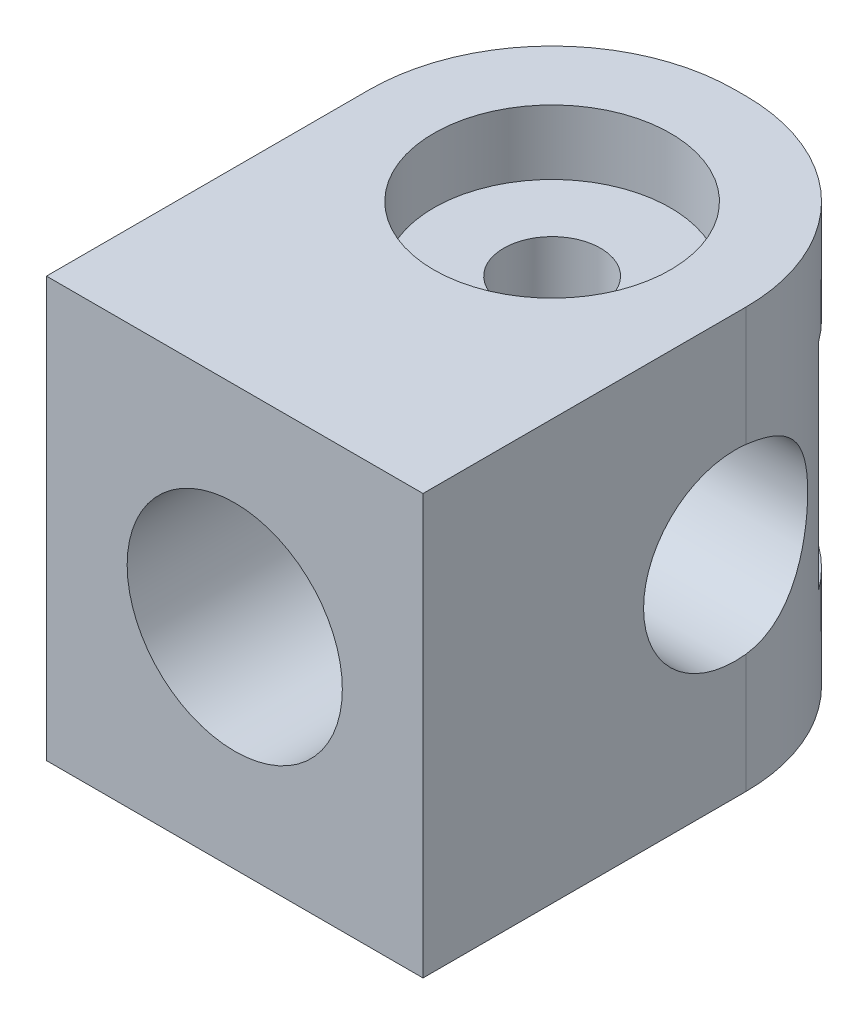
ISO-10303-21;
HEADER;
FILE_DESCRIPTION(('STEP AP214'),'2;1');
FILE_NAME('part.step','',(''),(''),'','','');
FILE_SCHEMA(('AUTOMOTIVE_DESIGN { 1 0 10303 214 1 1 1 1 }'));
ENDSEC;
DATA;
#1=APPLICATION_CONTEXT('core data for automotive mechanical design processes');
#2=APPLICATION_PROTOCOL_DEFINITION('international standard','automotive_design',2000,#1);
#3=PRODUCT_CONTEXT('',#1,'mechanical');
#4=PRODUCT('Part','Part','',(#3));
#5=PRODUCT_RELATED_PRODUCT_CATEGORY('part','',(#4));
#6=PRODUCT_DEFINITION_FORMATION('','',#4);
#7=PRODUCT_DEFINITION_CONTEXT('part definition',#1,'design');
#8=PRODUCT_DEFINITION('design','',#6,#7);
#9=PRODUCT_DEFINITION_SHAPE('','',#8);
#10=(LENGTH_UNIT() NAMED_UNIT(*) SI_UNIT(.MILLI.,.METRE.));
#11=(NAMED_UNIT(*) PLANE_ANGLE_UNIT() SI_UNIT($,.RADIAN.));
#12=(NAMED_UNIT(*) SI_UNIT($,.STERADIAN.) SOLID_ANGLE_UNIT());
#13=UNCERTAINTY_MEASURE_WITH_UNIT(LENGTH_MEASURE(1.E-05),#10,'distance_accuracy_value','');
#14=(GEOMETRIC_REPRESENTATION_CONTEXT(3) GLOBAL_UNCERTAINTY_ASSIGNED_CONTEXT((#13)) GLOBAL_UNIT_ASSIGNED_CONTEXT((#10,
#11,#12)) REPRESENTATION_CONTEXT('',''));
#15=CARTESIAN_POINT('',(0.,0.,0.));
#16=DIRECTION('',(0.,0.,1.));
#17=DIRECTION('',(1.,0.,0.));
#18=AXIS2_PLACEMENT_3D('',#15,#16,#17);
#19=CARTESIAN_POINT('',(17.5,-39.,17.5));
#20=DIRECTION('',(0.,1.,0.));
#21=DIRECTION('',(0.,0.,1.));
#22=AXIS2_PLACEMENT_3D('',#19,#20,#21);
#23=CYLINDRICAL_SURFACE('',#22,4.5);
#24=CARTESIAN_POINT('',(17.5,-27.,22.));
#25=CARTESIAN_POINT('',(17.3812277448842,-26.9999960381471,22.0000031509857));
#26=CARTESIAN_POINT('',(17.262486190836,-27.0025147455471,21.995294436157));
#27=CARTESIAN_POINT('',(17.0259169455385,-27.0124783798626,21.9765297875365));
#28=CARTESIAN_POINT('',(16.908089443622,-27.019924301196,21.962471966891));
#29=CARTESIAN_POINT('',(16.6741993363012,-27.0394641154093,21.9251652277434));
#30=CARTESIAN_POINT('',(16.5581381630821,-27.0515615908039,21.9019092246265));
#31=CARTESIAN_POINT('',(16.3286691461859,-27.0799410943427,21.8464858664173));
#32=CARTESIAN_POINT('',(16.215262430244,-27.0962248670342,21.8143147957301));
#33=CARTESIAN_POINT('',(15.8812611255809,-27.1503350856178,21.7052656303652));
#34=CARTESIAN_POINT('',(15.6655564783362,-27.1935421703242,21.6156351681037));
#35=CARTESIAN_POINT('',(15.2522300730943,-27.2889109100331,21.4053082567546));
#36=CARTESIAN_POINT('',(15.0546129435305,-27.3410748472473,21.2846038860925));
#37=CARTESIAN_POINT('',(14.6667979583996,-27.452668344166,21.0048946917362));
#38=CARTESIAN_POINT('',(14.4782430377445,-27.5123497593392,20.8437100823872));
#39=CARTESIAN_POINT('',(14.129518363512,-27.6286486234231,20.4918471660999));
#40=CARTESIAN_POINT('',(13.9693585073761,-27.6852649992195,20.3011586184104));
#41=CARTESIAN_POINT('',(13.750432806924,-27.7641328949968,19.9915340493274));
#42=CARTESIAN_POINT('',(13.6797373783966,-27.7898967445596,19.8817471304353));
#43=CARTESIAN_POINT('',(13.5478818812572,-27.8379463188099,19.6558841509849));
#44=CARTESIAN_POINT('',(13.4867177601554,-27.8602335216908,19.539810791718));
#45=CARTESIAN_POINT('',(13.3745490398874,-27.9005240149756,19.3021967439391));
#46=CARTESIAN_POINT('',(13.323540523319,-27.9185289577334,19.1806581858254));
#47=CARTESIAN_POINT('',(13.232226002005,-27.9495596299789,18.9330086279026));
#48=CARTESIAN_POINT('',(13.1919187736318,-27.9625859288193,18.8068981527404));
#49=CARTESIAN_POINT('',(13.1253749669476,-27.9822297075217,18.5618002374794));
#50=CARTESIAN_POINT('',(13.0982488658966,-27.989288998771,18.4430891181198));
#51=CARTESIAN_POINT('',(13.0536909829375,-27.9984034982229,18.2036748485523));
#52=CARTESIAN_POINT('',(13.0362583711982,-28.0004591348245,18.0829718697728));
#53=CARTESIAN_POINT('',(13.0112569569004,-27.9993691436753,17.8406179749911));
#54=CARTESIAN_POINT('',(13.0036843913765,-27.9962255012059,17.718967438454));
#55=CARTESIAN_POINT('',(12.9984212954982,-27.9846887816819,17.475706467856));
#56=CARTESIAN_POINT('',(13.0007303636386,-27.9762959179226,17.3540960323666));
#57=CARTESIAN_POINT('',(13.0145775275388,-27.9551876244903,17.1211250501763));
#58=CARTESIAN_POINT('',(13.025401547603,-27.9428487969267,17.0096873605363));
#59=CARTESIAN_POINT('',(13.0552077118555,-27.9139542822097,16.7884520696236));
#60=CARTESIAN_POINT('',(13.0741924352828,-27.897397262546,16.6786549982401));
#61=CARTESIAN_POINT('',(13.1430256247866,-27.8417792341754,16.3528578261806));
#62=CARTESIAN_POINT('',(13.2047653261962,-27.7967529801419,16.1402562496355));
#63=CARTESIAN_POINT('',(13.3600872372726,-27.6918882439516,15.7215336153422));
#64=CARTESIAN_POINT('',(13.4547768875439,-27.6315575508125,15.5159546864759));
#65=CARTESIAN_POINT('',(13.6721086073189,-27.5011702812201,15.1235329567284));
#66=CARTESIAN_POINT('',(13.7947613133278,-27.4311100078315,14.9366973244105));
#67=CARTESIAN_POINT('',(14.0811600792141,-27.2772520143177,14.5634666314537));
#68=CARTESIAN_POINT('',(14.248053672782,-27.1928102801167,14.3797484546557));
#69=CARTESIAN_POINT('',(14.6099783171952,-27.0245100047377,14.0417844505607));
#70=CARTESIAN_POINT('',(14.8050449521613,-26.9406523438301,13.8875764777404));
#71=CARTESIAN_POINT('',(15.2365863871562,-26.7754361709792,13.6014374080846));
#72=CARTESIAN_POINT('',(15.4750831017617,-26.6947540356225,13.4720962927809));
#73=CARTESIAN_POINT('',(15.8508545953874,-26.5898581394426,13.3108586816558));
#74=CARTESIAN_POINT('',(15.9790534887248,-26.5575917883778,13.2625897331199));
#75=CARTESIAN_POINT('',(16.2406700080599,-26.499803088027,13.1776168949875));
#76=CARTESIAN_POINT('',(16.3740853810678,-26.4742778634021,13.1409080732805));
#77=CARTESIAN_POINT('',(16.710370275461,-26.4209449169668,13.0650541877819));
#78=CARTESIAN_POINT('',(16.9157550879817,-26.3979543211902,13.033244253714));
#79=CARTESIAN_POINT('',(17.3300649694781,-26.372742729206,12.9984107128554));
#80=CARTESIAN_POINT('',(17.5389871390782,-26.3705054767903,12.9953645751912));
#81=CARTESIAN_POINT('',(17.9542812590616,-26.3870513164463,13.0181630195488));
#82=CARTESIAN_POINT('',(18.160654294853,-26.4058251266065,13.043994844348));
#83=CARTESIAN_POINT('',(18.565487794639,-26.4618975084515,13.1230875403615));
#84=CARTESIAN_POINT('',(18.7639422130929,-26.4992099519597,13.1763689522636));
#85=CARTESIAN_POINT('',(19.1557022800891,-26.5897125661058,13.3103631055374));
#86=CARTESIAN_POINT('',(19.3485717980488,-26.6434216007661,13.3919864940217));
#87=CARTESIAN_POINT('',(19.7187414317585,-26.760953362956,13.579504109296));
#88=CARTESIAN_POINT('',(19.8960347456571,-26.8247804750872,13.6854088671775));
#89=CARTESIAN_POINT('',(20.2636083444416,-26.9695643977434,13.9403485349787));
#90=CARTESIAN_POINT('',(20.4504860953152,-27.0515370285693,14.0937151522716));
#91=CARTESIAN_POINT('',(20.7975854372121,-27.2155138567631,14.4285072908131));
#92=CARTESIAN_POINT('',(20.9577844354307,-27.297518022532,14.6099563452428));
#93=CARTESIAN_POINT('',(21.1830290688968,-27.4196691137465,14.9109456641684));
#94=CARTESIAN_POINT('',(21.2585700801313,-27.4621221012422,15.0218435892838));
#95=CARTESIAN_POINT('',(21.3998600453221,-27.5440243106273,15.2507418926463));
#96=CARTESIAN_POINT('',(21.4656127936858,-27.5834746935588,15.3687394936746));
#97=CARTESIAN_POINT('',(21.5866376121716,-27.6584008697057,15.6111531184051));
#98=CARTESIAN_POINT('',(21.641912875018,-27.6938778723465,15.7355671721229));
#99=CARTESIAN_POINT('',(21.7412982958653,-27.7599790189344,15.9900213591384));
#100=CARTESIAN_POINT('',(21.7854099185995,-27.7906037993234,16.1200607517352));
#101=CARTESIAN_POINT('',(21.8588511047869,-27.8440741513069,16.3745723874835));
#102=CARTESIAN_POINT('',(21.8890561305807,-27.8673366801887,16.4987044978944));
#103=CARTESIAN_POINT('',(21.938895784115,-27.9085392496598,16.7499346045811));
#104=CARTESIAN_POINT('',(21.9585318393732,-27.9264800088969,16.8770321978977));
#105=CARTESIAN_POINT('',(21.9868589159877,-27.9566515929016,17.1330262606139));
#106=CARTESIAN_POINT('',(21.9955574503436,-27.9688863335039,17.2619214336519));
#107=CARTESIAN_POINT('',(22.0018097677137,-27.9874476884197,17.5204018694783));
#108=CARTESIAN_POINT('',(21.999364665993,-27.9937748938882,17.6499870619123));
#109=CARTESIAN_POINT('',(21.9842139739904,-28.0001049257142,17.8936468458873));
#110=CARTESIAN_POINT('',(21.9727272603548,-28.000754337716,18.007782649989));
#111=CARTESIAN_POINT('',(21.9410793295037,-27.9975145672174,18.2348162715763));
#112=CARTESIAN_POINT('',(21.920915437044,-27.9936239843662,18.3477136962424));
#113=CARTESIAN_POINT('',(21.8720985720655,-27.9815129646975,18.5713758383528));
#114=CARTESIAN_POINT('',(21.8434489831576,-27.9732942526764,18.6821413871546));
#115=CARTESIAN_POINT('',(21.7779292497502,-27.9528436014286,18.9008486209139));
#116=CARTESIAN_POINT('',(21.7410559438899,-27.9406101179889,19.0087892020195));
#117=CARTESIAN_POINT('',(21.619178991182,-27.8986612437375,19.3257132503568));
#118=CARTESIAN_POINT('',(21.5225097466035,-27.8635866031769,19.5296459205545));
#119=CARTESIAN_POINT('',(21.3010568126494,-27.7829082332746,19.9191523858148));
#120=CARTESIAN_POINT('',(21.1762650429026,-27.7373014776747,20.10472088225));
#121=CARTESIAN_POINT('',(20.8892971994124,-27.6355910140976,20.4700629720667));
#122=CARTESIAN_POINT('',(20.724778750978,-27.5789137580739,20.647841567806));
#123=CARTESIAN_POINT('',(20.3695925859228,-27.4643568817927,20.9747438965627));
#124=CARTESIAN_POINT('',(20.1789014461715,-27.4064762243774,21.1238416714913));
#125=CARTESIAN_POINT('',(19.7597552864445,-27.291869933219,21.4001179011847));
#126=CARTESIAN_POINT('',(19.5295485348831,-27.2355481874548,21.5248512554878));
#127=CARTESIAN_POINT('',(19.1691500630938,-27.1618031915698,21.681042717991));
#128=CARTESIAN_POINT('',(19.0465401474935,-27.1390161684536,21.7279460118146));
#129=CARTESIAN_POINT('',(18.7970292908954,-27.0979073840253,21.8110300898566));
#130=CARTESIAN_POINT('',(18.6701299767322,-27.0795839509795,21.8472148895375));
#131=CARTESIAN_POINT('',(18.3719124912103,-27.0432152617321,21.9181621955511));
#132=CARTESIAN_POINT('',(18.1993472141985,-27.0271263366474,21.9487826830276));
#133=CARTESIAN_POINT('',(17.8511651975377,-27.0055226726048,21.9896972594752));
#134=CARTESIAN_POINT('',(17.6755490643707,-27.0000058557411,21.9999953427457));
#135=CARTESIAN_POINT('',(17.5,-27.,22.));
#136=B_SPLINE_CURVE_WITH_KNOTS('',3,(#24,#25,#26,#27,#28,#29,#30,#31,#32,#33,#34,#35,#36,#37,
#38,#39,#40,#41,#42,#43,#44,#45,#46,#47,#48,#49,#50,#51,#52,#53,#54,#55,#56,#57,#58,#59,#60,#61,
#62,#63,#64,#65,#66,#67,#68,#69,#70,#71,#72,#73,#74,#75,#76,#77,#78,#79,#80,#81,#82,#83,#84,#85,
#86,#87,#88,#89,#90,#91,#92,#93,#94,#95,#96,#97,#98,#99,#100,#101,#102,#103,#104,#105,#106,#107,
#108,#109,#110,#111,#112,#113,#114,#115,#116,#117,#118,#119,#120,#121,#122,#123,#124,#125,#126,
#127,#128,#129,#130,#131,#132,#133,#134,#135),.UNSPECIFIED.,.T.,.F.,(4,2,2,2,2,2,2,2,2,2,2,2,2,
2,2,2,2,2,2,2,2,2,2,2,2,2,2,2,2,2,2,2,2,2,2,2,2,2,2,2,2,2,2,2,2,2,2,2,2,2,2,2,2,2,2,4),(0.,
0.356144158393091,0.712360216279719,1.06885117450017,1.42549093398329,2.13476597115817,
2.84422200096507,3.60640487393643,4.3688528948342,4.7676970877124,5.16637123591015,
5.56489130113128,5.96336577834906,6.32880274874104,6.6942084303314,7.0594746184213,
7.42472596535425,7.76224366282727,8.09986811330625,8.77453388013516,9.47450377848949,
10.1747403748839,10.9579719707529,11.7422016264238,12.5861396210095,13.007723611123,
13.4291274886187,14.0534056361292,14.6771947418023,15.3007083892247,15.9246892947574,
16.5709266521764,17.2174448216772,17.9802839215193,18.7437657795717,19.1655119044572,
19.5870941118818,20.0085476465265,20.4299458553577,20.8189606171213,21.2079228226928,
21.59661770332,21.9852736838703,22.3289978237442,22.6728280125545,23.0165212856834,
23.3603469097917,24.0423823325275,24.7246139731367,25.4677285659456,26.2115125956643,
27.010448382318,27.4096854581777,27.8087727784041,28.3352683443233,28.8616604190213),.UNSPECIFIED.);
#137=CARTESIAN_POINT('',(17.5,-27.,22.));
#138=VERTEX_POINT('',#137);
#139=EDGE_CURVE('E202',#138,#138,#136,.T.);
#140=ORIENTED_EDGE('',*,*,#139,.F.);
#141=EDGE_LOOP('',(#140));
#142=FACE_BOUND('',#141,.T.);
#143=CARTESIAN_POINT('',(17.5,-33.,17.5));
#144=DIRECTION('',(0.,-1.,0.));
#145=DIRECTION('',(0.,0.,-1.));
#146=AXIS2_PLACEMENT_3D('',#143,#144,#145);
#147=CIRCLE('',#146,4.5);
#148=CARTESIAN_POINT('',(17.5,-33.,13.));
#149=VERTEX_POINT('',#148);
#150=EDGE_CURVE('E255',#149,#149,#147,.F.);
#151=ORIENTED_EDGE('',*,*,#150,.F.);
#152=EDGE_LOOP('',(#151));
#153=FACE_BOUND('',#152,.T.);
#154=ADVANCED_FACE('F47',(#142,#153),#23,.F.);
#155=CARTESIAN_POINT('',(13.0278640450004,-11.,18.));
#156=CARTESIAN_POINT('',(13.0410960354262,-10.9999970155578,18.1183807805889));
#157=CARTESIAN_POINT('',(13.0590342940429,-11.0024770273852,18.2362010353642));
#158=CARTESIAN_POINT('',(13.1041541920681,-11.0121931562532,18.4698945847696));
#159=CARTESIAN_POINT('',(13.1313376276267,-11.0194301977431,18.5857674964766));
#160=CARTESIAN_POINT('',(13.1947016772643,-11.0383563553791,18.8147336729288));
#161=CARTESIAN_POINT('',(13.2308882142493,-11.050048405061,18.9278250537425));
#162=CARTESIAN_POINT('',(13.3118898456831,-11.0774583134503,19.1503882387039));
#163=CARTESIAN_POINT('',(13.356708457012,-11.0931778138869,19.2598585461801));
#164=CARTESIAN_POINT('',(13.50308584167,-11.1454932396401,19.5807916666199));
#165=CARTESIAN_POINT('',(13.6168990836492,-11.1873528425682,19.785965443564));
#166=CARTESIAN_POINT('',(13.8736042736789,-11.2804446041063,20.1746252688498));
#167=CARTESIAN_POINT('',(14.0165012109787,-11.3316783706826,20.3581075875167));
#168=CARTESIAN_POINT('',(14.3384631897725,-11.4419169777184,20.7117970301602));
#169=CARTESIAN_POINT('',(14.5193094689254,-11.5012124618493,20.8802923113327));
#170=CARTESIAN_POINT('',(14.9067047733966,-11.617929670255,21.1858723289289));
#171=CARTESIAN_POINT('',(15.1132678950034,-11.6753503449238,21.3229397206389));
#172=CARTESIAN_POINT('',(15.4446044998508,-11.7561219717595,21.5052938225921));
#173=CARTESIAN_POINT('',(15.5617517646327,-11.7827236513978,21.5632939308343));
#174=CARTESIAN_POINT('',(15.8012535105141,-11.8324619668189,21.6690975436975));
#175=CARTESIAN_POINT('',(15.9236056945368,-11.855600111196,21.7169054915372));
#176=CARTESIAN_POINT('',(16.1726201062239,-11.8974563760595,21.8017854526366));
#177=CARTESIAN_POINT('',(16.2992793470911,-11.9161774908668,21.8388647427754));
#178=CARTESIAN_POINT('',(16.5559965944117,-11.9483912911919,21.9018536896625));
#179=CARTESIAN_POINT('',(16.6860541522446,-11.9618846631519,21.9277648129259));
#180=CARTESIAN_POINT('',(16.9371182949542,-11.9820976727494,21.9663048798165));
#181=CARTESIAN_POINT('',(17.0579406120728,-11.9893003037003,21.9798849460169));
#182=CARTESIAN_POINT('',(17.3004821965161,-11.9985104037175,21.9972180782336));
#183=CARTESIAN_POINT('',(17.4222013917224,-12.0005182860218,22.0009719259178));
#184=CARTESIAN_POINT('',(17.6654857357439,-11.999253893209,21.9986008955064));
#185=CARTESIAN_POINT('',(17.7870509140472,-11.9959828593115,21.9924783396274));
#186=CARTESIAN_POINT('',(18.0290357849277,-11.9843019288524,21.970445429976));
#187=CARTESIAN_POINT('',(18.1494555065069,-11.9758921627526,21.9545353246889));
#188=CARTESIAN_POINT('',(18.3789688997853,-11.9551150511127,21.9147378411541));
#189=CARTESIAN_POINT('',(18.4882189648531,-11.9431035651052,21.8915615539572));
#190=CARTESIAN_POINT('',(18.7042740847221,-11.9154056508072,21.8372971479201));
#191=CARTESIAN_POINT('',(18.8110783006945,-11.8997179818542,21.8062063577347));
#192=CARTESIAN_POINT('',(19.1268646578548,-11.8478649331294,21.7014789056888));
#193=CARTESIAN_POINT('',(19.3313673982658,-11.8068951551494,21.6163612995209));
#194=CARTESIAN_POINT('',(19.7381982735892,-11.7135723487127,21.4110225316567));
#195=CARTESIAN_POINT('',(19.9393320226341,-11.6606160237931,21.2887314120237));
#196=CARTESIAN_POINT('',(20.319635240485,-11.5512862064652,21.0149158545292));
#197=CARTESIAN_POINT('',(20.4987918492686,-11.4949107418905,20.8633744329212));
#198=CARTESIAN_POINT('',(20.8483888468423,-11.3790875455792,20.5173630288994));
#199=CARTESIAN_POINT('',(21.0162145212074,-11.3198874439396,20.3201295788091));
#200=CARTESIAN_POINT('',(21.2414204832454,-11.2388223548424,20.0037178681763));
#201=CARTESIAN_POINT('',(21.3120981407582,-11.213077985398,19.8947557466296));
#202=CARTESIAN_POINT('',(21.4440403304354,-11.1649979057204,19.6705827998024));
#203=CARTESIAN_POINT('',(21.5053096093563,-11.1426604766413,19.5553751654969));
#204=CARTESIAN_POINT('',(21.616422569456,-11.1026933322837,19.3224434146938));
#205=CARTESIAN_POINT('',(21.6665153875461,-11.0849591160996,19.2048559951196));
#206=CARTESIAN_POINT('',(21.7566528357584,-11.0541338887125,18.9653548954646));
#207=CARTESIAN_POINT('',(21.7967023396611,-11.0410406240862,18.8434433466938));
#208=CARTESIAN_POINT('',(21.8663069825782,-11.0200342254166,18.59628399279));
#209=CARTESIAN_POINT('',(21.8958672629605,-11.0121185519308,18.471037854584));
#210=CARTESIAN_POINT('',(21.9441716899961,-11.0018614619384,18.2182552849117));
#211=CARTESIAN_POINT('',(21.9629169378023,-10.9995194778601,18.0907190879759));
#212=CARTESIAN_POINT('',(21.988067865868,-11.0005884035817,17.8473835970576));
#213=CARTESIAN_POINT('',(21.9955218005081,-11.0034463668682,17.7316887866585));
#214=CARTESIAN_POINT('',(22.001489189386,-11.0139132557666,17.5002449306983));
#215=CARTESIAN_POINT('',(21.9999997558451,-11.0215237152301,17.3844958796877));
#216=CARTESIAN_POINT('',(21.9881551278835,-11.0414241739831,17.1539071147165));
#217=CARTESIAN_POINT('',(21.9778039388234,-11.0537120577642,17.0390670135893));
#218=CARTESIAN_POINT('',(21.9484379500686,-11.082775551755,16.8110609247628));
#219=CARTESIAN_POINT('',(21.9294198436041,-11.0995528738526,16.6978955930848));
#220=CARTESIAN_POINT('',(21.8609228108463,-11.1552603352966,16.3678018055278));
#221=CARTESIAN_POINT('',(21.7996575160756,-11.200115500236,16.1541850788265));
#222=CARTESIAN_POINT('',(21.6478897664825,-11.3028627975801,15.7411498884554));
#223=CARTESIAN_POINT('',(21.5573812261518,-11.3607576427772,15.5417343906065));
#224=CARTESIAN_POINT('',(21.3409934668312,-11.491332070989,15.1436355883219));
#225=CARTESIAN_POINT('',(21.2127166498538,-11.5648610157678,14.9465351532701));
#226=CARTESIAN_POINT('',(20.9283978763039,-11.7176249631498,14.5758300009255));
#227=CARTESIAN_POINT('',(20.7723285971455,-11.7968655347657,14.4022487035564));
#228=CARTESIAN_POINT('',(20.4151245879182,-11.9646067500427,14.0619887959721));
#229=CARTESIAN_POINT('',(20.2108368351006,-12.0530868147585,13.8985917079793));
#230=CARTESIAN_POINT('',(19.7743751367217,-12.2205426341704,13.6082339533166));
#231=CARTESIAN_POINT('',(19.5422212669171,-12.2995251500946,13.4812472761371));
#232=CARTESIAN_POINT('',(19.1009958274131,-12.4242253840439,13.2889502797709));
#233=CARTESIAN_POINT('',(18.8960738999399,-12.4734193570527,13.2164747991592));
#234=CARTESIAN_POINT('',(18.5801324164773,-12.5332128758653,13.1301872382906));
#235=CARTESIAN_POINT('',(18.4734007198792,-12.5508103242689,13.105163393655));
#236=CARTESIAN_POINT('',(18.2577047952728,-12.5807783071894,13.0628904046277));
#237=CARTESIAN_POINT('',(18.1487415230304,-12.5931510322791,13.0456380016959));
#238=CARTESIAN_POINT('',(17.9287674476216,-12.6122669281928,13.0190962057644));
#239=CARTESIAN_POINT('',(17.8177488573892,-12.6189799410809,13.0098494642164));
#240=CARTESIAN_POINT('',(17.5951291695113,-12.6264055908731,12.9996259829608));
#241=CARTESIAN_POINT('',(17.483528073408,-12.6271182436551,12.9986492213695));
#242=CARTESIAN_POINT('',(17.2606627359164,-12.6225104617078,13.0049869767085));
#243=CARTESIAN_POINT('',(17.1493985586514,-12.6171889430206,13.0123029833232));
#244=CARTESIAN_POINT('',(16.9281754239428,-12.6007335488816,13.0350923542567));
#245=CARTESIAN_POINT('',(16.8182164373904,-12.5895998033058,13.050565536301));
#246=CARTESIAN_POINT('',(16.5078250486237,-12.5501344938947,13.1059843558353));
#247=CARTESIAN_POINT('',(16.3098500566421,-12.5152273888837,13.155553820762));
#248=CARTESIAN_POINT('',(15.9253564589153,-12.4307885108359,13.279639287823));
#249=CARTESIAN_POINT('',(15.7388421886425,-12.381251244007,13.354164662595));
#250=CARTESIAN_POINT('',(15.3587350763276,-12.265750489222,13.5358640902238));
#251=CARTESIAN_POINT('',(15.1668608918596,-12.1985440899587,13.6458352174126));
#252=CARTESIAN_POINT('',(14.8027475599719,-12.0576775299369,13.8912457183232));
#253=CARTESIAN_POINT('',(14.6305225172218,-11.9840127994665,14.0267032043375));
#254=CARTESIAN_POINT('',(14.2795071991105,-11.8227775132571,14.3465543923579));
#255=CARTESIAN_POINT('',(14.1048042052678,-11.7350209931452,14.5353623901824));
#256=CARTESIAN_POINT('',(13.7887452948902,-11.5660435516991,14.9421054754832));
#257=CARTESIAN_POINT('',(13.647406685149,-11.4848260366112,15.160055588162));
#258=CARTESIAN_POINT('',(13.4627467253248,-11.3725819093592,15.5079186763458));
#259=CARTESIAN_POINT('',(13.4052670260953,-11.3364146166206,15.6288430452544));
#260=CARTESIAN_POINT('',(13.3009664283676,-11.2685550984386,15.876384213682));
#261=CARTESIAN_POINT('',(13.2541401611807,-11.2368606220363,16.0029981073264));
#262=CARTESIAN_POINT('',(13.1718642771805,-11.1787771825,16.260836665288));
#263=CARTESIAN_POINT('',(13.1363974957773,-11.1523802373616,16.3920540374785));
#264=CARTESIAN_POINT('',(13.0773547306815,-11.1055027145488,16.6581126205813));
#265=CARTESIAN_POINT('',(13.0537739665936,-11.0850197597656,16.7929523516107));
#266=CARTESIAN_POINT('',(13.0137929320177,-11.0453221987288,17.1055539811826));
#267=CARTESIAN_POINT('',(13.001612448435,-11.0282956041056,17.2841571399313));
#268=CARTESIAN_POINT('',(12.9986883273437,-11.0056374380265,17.6422638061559));
#269=CARTESIAN_POINT('',(13.0079421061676,-11.0000044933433,17.8217672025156));
#270=CARTESIAN_POINT('',(13.0278640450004,-11.,18.));
#271=B_SPLINE_CURVE_WITH_KNOTS('',3,(#155,#156,#157,#158,#159,#160,#161,#162,#163,#164,#165,
#166,#167,#168,#169,#170,#171,#172,#173,#174,#175,#176,#177,#178,#179,#180,#181,#182,#183,#184,
#185,#186,#187,#188,#189,#190,#191,#192,#193,#194,#195,#196,#197,#198,#199,#200,#201,#202,#203,
#204,#205,#206,#207,#208,#209,#210,#211,#212,#213,#214,#215,#216,#217,#218,#219,#220,#221,#222,
#223,#224,#225,#226,#227,#228,#229,#230,#231,#232,#233,#234,#235,#236,#237,#238,#239,#240,#241,
#242,#243,#244,#245,#246,#247,#248,#249,#250,#251,#252,#253,#254,#255,#256,#257,#258,#259,#260,
#261,#262,#263,#264,#265,#266,#267,#268,#269,#270),.UNSPECIFIED.,.T.,.F.,(4,2,2,2,2,2,2,2,2,2,2,
2,2,2,2,2,2,2,2,2,2,2,2,2,2,2,2,2,2,2,2,2,2,2,2,2,2,2,2,2,2,2,2,2,2,2,2,2,2,2,2,2,2,2,2,2,2,4),
(0.,0.357176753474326,0.714422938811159,1.07190477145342,1.42953255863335,2.1411176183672,
2.85282485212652,3.61219301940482,4.37197927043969,4.77172859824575,5.17130329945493,
5.57060634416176,5.96985693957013,6.33474964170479,6.69961331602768,7.06439121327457,
7.42915984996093,7.76575352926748,8.10246096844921,8.77543142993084,9.49637841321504,
10.2177452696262,11.0104604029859,11.4072482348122,11.8038352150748,12.1904224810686,
12.576821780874,12.9630314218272,13.3492017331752,13.696676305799,14.0442630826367,
14.3916928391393,14.7392552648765,15.4162348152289,16.0933553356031,16.8295722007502,
17.566516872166,18.391188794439,19.2152701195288,19.8808372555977,20.2135694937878,
20.5461620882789,20.8805159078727,21.2148688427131,21.5492818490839,21.8836873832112,
22.5020407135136,23.1206265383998,23.8114794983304,24.502825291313,25.3146638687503,
26.1269226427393,26.5424917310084,26.9578509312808,27.3725795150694,27.7871411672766,
28.3249673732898,28.8627287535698),.UNSPECIFIED.);
#272=CARTESIAN_POINT('',(13.0278640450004,-11.,18.));
#273=VERTEX_POINT('',#272);
#274=EDGE_CURVE('E211',#273,#273,#271,.T.);
#275=ORIENTED_EDGE('',*,*,#274,.F.);
#276=EDGE_LOOP('',(#275));
#277=FACE_BOUND('',#276,.T.);
#278=CARTESIAN_POINT('',(17.5,-6.,17.5));
#279=DIRECTION('',(0.,1.,0.));
#280=DIRECTION('',(0.,0.,1.));
#281=AXIS2_PLACEMENT_3D('',#278,#279,#280);
#282=CIRCLE('',#281,4.5);
#283=CARTESIAN_POINT('',(17.5,-6.,22.));
#284=VERTEX_POINT('',#283);
#285=EDGE_CURVE('E212',#284,#284,#282,.F.);
#286=ORIENTED_EDGE('',*,*,#285,.F.);
#287=EDGE_LOOP('',(#286));
#288=FACE_BOUND('',#287,.T.);
#289=ADVANCED_FACE('F221',(#277,#288),#23,.F.);
#290=CARTESIAN_POINT('',(0.,0.,0.));
#291=DIRECTION('',(0.,0.,1.));
#292=DIRECTION('',(1.,0.,0.));
#293=AXIS2_PLACEMENT_3D('',#290,#291,#292);
#294=PLANE('',#293);
#295=DIRECTION('',(-1.,0.,0.));
#296=VECTOR('',#295,1.);
#297=CARTESIAN_POINT('',(0.,-9.5,0.));
#298=LINE('',#297,#296);
#299=CARTESIAN_POINT('',(18.,-9.5,0.));
#300=VERTEX_POINT('',#299);
#301=CARTESIAN_POINT('',(17.,-9.5,0.));
#302=VERTEX_POINT('',#301);
#303=EDGE_CURVE('E287',#300,#302,#298,.T.);
#304=ORIENTED_EDGE('',*,*,#303,.T.);
#305=DIRECTION('',(0.,-1.,0.));
#306=VECTOR('',#305,1.);
#307=CARTESIAN_POINT('',(17.,0.,0.));
#308=LINE('',#307,#306);
#309=CARTESIAN_POINT('',(17.,0.,0.));
#310=VERTEX_POINT('',#309);
#311=EDGE_CURVE('E173',#302,#310,#308,.F.);
#312=ORIENTED_EDGE('',*,*,#311,.T.);
#313=DIRECTION('',(-1.,0.,0.));
#314=VECTOR('',#313,1.);
#315=CARTESIAN_POINT('',(0.,0.,0.));
#316=LINE('',#315,#314);
#317=CARTESIAN_POINT('',(18.,0.,0.));
#318=VERTEX_POINT('',#317);
#319=EDGE_CURVE('E327',#318,#310,#316,.T.);
#320=ORIENTED_EDGE('',*,*,#319,.F.);
#321=DIRECTION('',(0.,1.,0.));
#322=VECTOR('',#321,1.);
#323=CARTESIAN_POINT('',(18.,0.,0.));
#324=LINE('',#323,#322);
#325=EDGE_CURVE('E169',#318,#300,#324,.F.);
#326=ORIENTED_EDGE('',*,*,#325,.T.);
#327=EDGE_LOOP('',(#304,#312,#320,#326));
#328=FACE_BOUND('',#327,.T.);
#329=ADVANCED_FACE('F225',(#328),#294,.F.);
#330=CARTESIAN_POINT('',(17.,0.,17.));
#331=DIRECTION('',(0.,-1.,0.));
#332=DIRECTION('',(1.,0.,0.));
#333=AXIS2_PLACEMENT_3D('',#330,#331,#332);
#334=CYLINDRICAL_SURFACE('',#333,17.);
#335=CARTESIAN_POINT('',(0.,-15.1125178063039,17.));
#336=CARTESIAN_POINT('',(-1.15018497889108E-05,-15.1403187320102,16.8779552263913));
#337=CARTESIAN_POINT('',(0.00131393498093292,-15.1732390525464,16.7570854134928));
#338=CARTESIAN_POINT('',(0.006402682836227,-15.2490011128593,16.5185731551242));
#339=CARTESIAN_POINT('',(0.0101655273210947,-15.2918409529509,16.4009300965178));
#340=CARTESIAN_POINT('',(0.0198850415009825,-15.3870550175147,16.1698968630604));
#341=CARTESIAN_POINT('',(0.0258379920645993,-15.4394130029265,16.056499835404));
#342=CARTESIAN_POINT('',(0.0396327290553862,-15.5533135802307,15.8345377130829));
#343=CARTESIAN_POINT('',(0.0474745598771,-15.614856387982,15.7259727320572));
#344=CARTESIAN_POINT('',(0.0646997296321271,-15.7466607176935,15.5144496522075));
#345=CARTESIAN_POINT('',(0.0740824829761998,-15.8169189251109,15.4114894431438));
#346=CARTESIAN_POINT('',(0.0940117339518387,-15.9656701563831,15.2118034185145));
#347=CARTESIAN_POINT('',(0.104558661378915,-16.0441662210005,15.115079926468));
#348=CARTESIAN_POINT('',(0.13734312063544,-16.2912058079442,14.8352861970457));
#349=CARTESIAN_POINT('',(0.160740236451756,-16.4714139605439,14.6624114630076));
#350=CARTESIAN_POINT('',(0.207632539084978,-16.8610536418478,14.3462298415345));
#351=CARTESIAN_POINT('',(0.231122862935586,-17.070922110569,14.2034636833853));
#352=CARTESIAN_POINT('',(0.274448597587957,-17.5119864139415,13.9550247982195));
#353=CARTESIAN_POINT('',(0.294283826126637,-17.7431833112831,13.8493539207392));
#354=CARTESIAN_POINT('',(0.327448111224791,-18.220468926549,13.678303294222));
#355=CARTESIAN_POINT('',(0.340777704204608,-18.4665564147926,13.6129202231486));
#356=CARTESIAN_POINT('',(0.358990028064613,-18.9665080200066,13.5245342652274));
#357=CARTESIAN_POINT('',(0.363874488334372,-19.2203705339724,13.5015227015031));
#358=CARTESIAN_POINT('',(0.364479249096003,-19.7233530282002,13.4986519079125));
#359=CARTESIAN_POINT('',(0.360377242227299,-19.9724684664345,13.5179559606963));
#360=CARTESIAN_POINT('',(0.343953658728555,-20.4638381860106,13.5973930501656));
#361=CARTESIAN_POINT('',(0.331631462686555,-20.7060919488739,13.6575291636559));
#362=CARTESIAN_POINT('',(0.300522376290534,-21.1765663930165,13.816611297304));
#363=CARTESIAN_POINT('',(0.281745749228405,-21.4048086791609,13.9154957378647));
#364=CARTESIAN_POINT('',(0.24029362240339,-21.841742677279,14.1493419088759));
#365=CARTESIAN_POINT('',(0.217617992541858,-22.0504337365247,14.2843048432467));
#366=CARTESIAN_POINT('',(0.182817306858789,-22.3464453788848,14.5123440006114));
#367=CARTESIAN_POINT('',(0.170963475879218,-22.4431550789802,14.5935665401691));
#368=CARTESIAN_POINT('',(0.147491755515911,-22.6294177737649,14.7638542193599));
#369=CARTESIAN_POINT('',(0.135873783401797,-22.7189733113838,14.8529165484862));
#370=CARTESIAN_POINT('',(0.113302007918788,-22.8903470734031,15.0383287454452));
#371=CARTESIAN_POINT('',(0.102348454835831,-22.9721623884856,15.1346813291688));
#372=CARTESIAN_POINT('',(0.081537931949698,-23.1274238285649,15.3339648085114));
#373=CARTESIAN_POINT('',(0.0716805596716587,-23.2008730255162,15.4368932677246));
#374=CARTESIAN_POINT('',(0.053041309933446,-23.3420858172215,15.653544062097));
#375=CARTESIAN_POINT('',(0.044329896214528,-23.4094316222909,15.7675452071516));
#376=CARTESIAN_POINT('',(0.0289656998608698,-23.5338703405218,16.0011483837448));
#377=CARTESIAN_POINT('',(0.022312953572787,-23.5909630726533,16.1207505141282));
#378=CARTESIAN_POINT('',(0.011428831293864,-23.694520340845,16.3648840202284));
#379=CARTESIAN_POINT('',(0.00720267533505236,-23.7409618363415,16.4894254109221));
#380=CARTESIAN_POINT('',(0.00148073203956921,-23.8226888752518,16.7422020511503));
#381=CARTESIAN_POINT('',(-1.45310442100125E-05,-23.8579722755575,16.8704380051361));
#382=CARTESIAN_POINT('',(0.,-23.8874821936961,17.));
#383=B_SPLINE_CURVE_WITH_KNOTS('',3,(#335,#336,#337,#338,#339,#340,#341,#342,#343,#344,#345,
#346,#347,#348,#349,#350,#351,#352,#353,#354,#355,#356,#357,#358,#359,#360,#361,#362,#363,#364,
#365,#366,#367,#368,#369,#370,#371,#372,#373,#374,#375,#376,#377,#378,#379,#380,#381,#382),
.UNSPECIFIED.,.F.,.F.,(4,2,2,2,2,2,2,2,2,2,2,2,2,2,2,2,2,2,2,2,2,2,2,4),(0.,0.375385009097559,
0.750698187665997,1.1253769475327,1.50006451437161,1.87461001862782,2.24929426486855,
2.99802771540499,3.75923817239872,4.52048657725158,5.28167220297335,6.04270193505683,
6.78881959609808,7.53499348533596,8.27998631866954,9.02500401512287,9.40518099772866,
9.78522224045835,10.1654057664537,10.5454492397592,10.9430001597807,11.3405580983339,
11.7389680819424,12.1374545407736),.UNSPECIFIED.);
#384=CARTESIAN_POINT('',(0.,-15.112517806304,17.));
#385=VERTEX_POINT('',#384);
#386=CARTESIAN_POINT('',(0.,-23.8874821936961,17.));
#387=VERTEX_POINT('',#386);
#388=EDGE_CURVE('E63',#385,#387,#383,.T.);
#389=ORIENTED_EDGE('',*,*,#388,.F.);
#390=DIRECTION('',(0.,-1.,0.));
#391=VECTOR('',#390,1.);
#392=CARTESIAN_POINT('',(0.,0.,17.));
#393=LINE('',#392,#391);
#394=CARTESIAN_POINT('',(0.,0.,17.));
#395=VERTEX_POINT('',#394);
#396=EDGE_CURVE('E143',#395,#385,#393,.T.);
#397=ORIENTED_EDGE('',*,*,#396,.F.);
#398=CARTESIAN_POINT('',(17.,0.,17.));
#399=DIRECTION('',(0.,-1.,0.));
#400=DIRECTION('',(0.,0.,-1.));
#401=AXIS2_PLACEMENT_3D('',#398,#399,#400);
#402=CIRCLE('',#401,17.);
#403=EDGE_CURVE('E181',#310,#395,#402,.F.);
#404=ORIENTED_EDGE('',*,*,#403,.F.);
#405=ORIENTED_EDGE('',*,*,#311,.F.);
#406=CARTESIAN_POINT('',(17.,-9.5,17.));
#407=DIRECTION('',(0.,-1.,0.));
#408=DIRECTION('',(0.,0.,-1.));
#409=AXIS2_PLACEMENT_3D('',#406,#407,#408);
#410=CIRCLE('',#409,17.);
#411=CARTESIAN_POINT('',(3.25227291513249,-9.5,7.));
#412=VERTEX_POINT('',#411);
#413=EDGE_CURVE('E309',#302,#412,#410,.F.);
#414=ORIENTED_EDGE('',*,*,#413,.T.);
#415=DIRECTION('',(0.,-1.,0.));
#416=VECTOR('',#415,1.);
#417=CARTESIAN_POINT('',(3.25227291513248,0.,7.));
#418=LINE('',#417,#416);
#419=CARTESIAN_POINT('',(3.25227291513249,-29.5,7.));
#420=VERTEX_POINT('',#419);
#421=EDGE_CURVE('E297',#412,#420,#418,.T.);
#422=ORIENTED_EDGE('',*,*,#421,.T.);
#423=CARTESIAN_POINT('',(17.,-29.5,17.));
#424=DIRECTION('',(0.,-1.,0.));
#425=DIRECTION('',(0.,0.,-1.));
#426=AXIS2_PLACEMENT_3D('',#423,#424,#425);
#427=CIRCLE('',#426,17.);
#428=CARTESIAN_POINT('',(17.,-29.5,0.));
#429=VERTEX_POINT('',#428);
#430=EDGE_CURVE('E306',#429,#420,#427,.F.);
#431=ORIENTED_EDGE('',*,*,#430,.F.);
#432=CARTESIAN_POINT('',(17.,-39.,0.));
#433=VERTEX_POINT('',#432);
#434=EDGE_CURVE('E174',#433,#429,#308,.F.);
#435=ORIENTED_EDGE('',*,*,#434,.F.);
#436=CARTESIAN_POINT('',(17.,-39.,17.));
#437=DIRECTION('',(0.,1.,0.));
#438=DIRECTION('',(0.,0.,1.));
#439=AXIS2_PLACEMENT_3D('',#436,#437,#438);
#440=CIRCLE('',#439,17.);
#441=CARTESIAN_POINT('',(0.,-39.,17.));
#442=VERTEX_POINT('',#441);
#443=EDGE_CURVE('E160',#442,#433,#440,.F.);
#444=ORIENTED_EDGE('',*,*,#443,.F.);
#445=EDGE_CURVE('E145',#387,#442,#393,.T.);
#446=ORIENTED_EDGE('',*,*,#445,.F.);
#447=EDGE_LOOP('',(#389,#397,#404,#405,#414,#422,#431,#435,#444,#446));
#448=FACE_BOUND('',#447,.T.);
#449=ADVANCED_FACE('F141',(#448),#334,.T.);
#450=CARTESIAN_POINT('',(18.,0.,17.));
#451=DIRECTION('',(0.,1.,0.));
#452=DIRECTION('',(-1.,0.,0.));
#453=AXIS2_PLACEMENT_3D('',#450,#451,#452);
#454=CYLINDRICAL_SURFACE('',#453,17.);
#455=CARTESIAN_POINT('',(35.,-27.9409715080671,17.));
#456=CARTESIAN_POINT('',(35.0000397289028,-27.9142723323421,16.7743139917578));
#457=CARTESIAN_POINT('',(34.99550727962,-27.878453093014,16.5497392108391));
#458=CARTESIAN_POINT('',(34.9778527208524,-27.7890762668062,16.104597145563));
#459=CARTESIAN_POINT('',(34.9647346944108,-27.735527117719,15.8840280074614));
#460=CARTESIAN_POINT('',(34.9305381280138,-27.6114397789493,15.4494236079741));
#461=CARTESIAN_POINT('',(34.9094948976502,-27.5409774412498,15.2353638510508));
#462=CARTESIAN_POINT('',(34.8602286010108,-27.3836125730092,14.8142216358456));
#463=CARTESIAN_POINT('',(34.8320049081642,-27.2967086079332,14.6071397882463));
#464=CARTESIAN_POINT('',(34.7693495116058,-27.1073835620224,14.2016193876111));
#465=CARTESIAN_POINT('',(34.7349286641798,-27.0049896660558,14.0031664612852));
#466=CARTESIAN_POINT('',(34.6608802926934,-26.785385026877,13.615615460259));
#467=CARTESIAN_POINT('',(34.6212508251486,-26.6681687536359,13.4265209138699));
#468=CARTESIAN_POINT('',(34.4961520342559,-26.2953791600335,12.8745879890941));
#469=CARTESIAN_POINT('',(34.404479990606,-26.0186871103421,12.5271472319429));
#470=CARTESIAN_POINT('',(34.2085478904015,-25.3975039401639,11.8608364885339));
#471=CARTESIAN_POINT('',(34.1038616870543,-25.0499210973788,11.5449721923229));
#472=CARTESIAN_POINT('',(33.9503283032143,-24.4928767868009,11.1169647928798));
#473=CARTESIAN_POINT('',(33.899706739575,-24.3011370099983,10.9818665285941));
#474=CARTESIAN_POINT('',(33.8011444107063,-23.9065783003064,10.7276478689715));
#475=CARTESIAN_POINT('',(33.7532039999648,-23.7037579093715,10.6085295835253));
#476=CARTESIAN_POINT('',(33.659682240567,-23.2796014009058,10.3826040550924));
#477=CARTESIAN_POINT('',(33.6142799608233,-23.0578465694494,10.2765079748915));
#478=CARTESIAN_POINT('',(33.5297978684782,-22.6050394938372,10.0836087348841));
#479=CARTESIAN_POINT('',(33.4907152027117,-22.3739915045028,9.9967968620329));
#480=CARTESIAN_POINT('',(33.4204331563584,-21.9042426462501,9.8433688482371));
#481=CARTESIAN_POINT('',(33.3892295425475,-21.6655459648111,9.77674185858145));
#482=CARTESIAN_POINT('',(33.3360198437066,-21.1822710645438,9.66444465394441));
#483=CARTESIAN_POINT('',(33.3140127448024,-20.9376934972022,9.61877212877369));
#484=CARTESIAN_POINT('',(33.2815126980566,-20.4640926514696,9.5517358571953));
#485=CARTESIAN_POINT('',(33.2702531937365,-20.2353507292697,9.52874891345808));
#486=CARTESIAN_POINT('',(33.2568375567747,-19.7764925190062,9.50139035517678));
#487=CARTESIAN_POINT('',(33.2546809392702,-19.5463763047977,9.49701774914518));
#488=CARTESIAN_POINT('',(33.259558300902,-19.0866931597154,9.50694265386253));
#489=CARTESIAN_POINT('',(33.2665905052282,-18.8571261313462,9.5212365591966));
#490=CARTESIAN_POINT('',(33.2895581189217,-18.4003516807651,9.56830465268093));
#491=CARTESIAN_POINT('',(33.3054933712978,-18.1731442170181,9.60107851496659));
#492=CARTESIAN_POINT('',(33.3443765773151,-17.7369773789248,9.68207798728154));
#493=CARTESIAN_POINT('',(33.3668218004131,-17.5277675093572,9.72920508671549));
#494=CARTESIAN_POINT('',(33.4182423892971,-17.1141864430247,9.83889196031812));
#495=CARTESIAN_POINT('',(33.4472199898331,-16.9098169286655,9.90145701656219));
#496=CARTESIAN_POINT('',(33.5107901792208,-16.5071679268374,10.0414591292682));
#497=CARTESIAN_POINT('',(33.5453820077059,-16.3088876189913,10.1188941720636));
#498=CARTESIAN_POINT('',(33.6191615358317,-15.919366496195,10.288047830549));
#499=CARTESIAN_POINT('',(33.6583510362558,-15.7281284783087,10.3797720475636));
#500=CARTESIAN_POINT('',(33.786531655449,-15.1419617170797,10.6883313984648));
#501=CARTESIAN_POINT('',(33.881786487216,-14.7608835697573,10.9294806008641));
#502=CARTESIAN_POINT('',(34.0773527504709,-14.0421868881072,11.4682170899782));
#503=CARTESIAN_POINT('',(34.1776672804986,-13.7045954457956,11.7658392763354));
#504=CARTESIAN_POINT('',(34.3278180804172,-13.2230445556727,12.2633511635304));
#505=CARTESIAN_POINT('',(34.3797387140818,-13.061194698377,12.4456044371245));
#506=CARTESIAN_POINT('',(34.4802359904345,-12.7533649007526,12.8238708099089));
#507=CARTESIAN_POINT('',(34.5288138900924,-12.6073789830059,13.0198786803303));
#508=CARTESIAN_POINT('',(34.6210144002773,-12.3324559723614,13.4244026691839));
#509=CARTESIAN_POINT('',(34.6646403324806,-12.2035074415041,13.6329102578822));
#510=CARTESIAN_POINT('',(34.7454655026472,-11.9637103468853,14.0611537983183));
#511=CARTESIAN_POINT('',(34.7826682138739,-11.8528520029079,14.2808835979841));
#512=CARTESIAN_POINT('',(34.8450571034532,-11.6631751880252,14.7014550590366));
#513=CARTESIAN_POINT('',(34.8711706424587,-11.5820737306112,14.9011325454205));
#514=CARTESIAN_POINT('',(34.916692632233,-11.4350866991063,15.3067314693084));
#515=CARTESIAN_POINT('',(34.9361022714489,-11.369198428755,15.5126517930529));
#516=CARTESIAN_POINT('',(34.9675956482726,-11.2530136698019,15.9301490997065));
#517=CARTESIAN_POINT('',(34.9796546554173,-11.2027700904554,16.1417427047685));
#518=CARTESIAN_POINT('',(34.9958756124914,-11.1185659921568,16.5685506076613));
#519=CARTESIAN_POINT('',(35.0000335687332,-11.0846137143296,16.7837666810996));
#520=CARTESIAN_POINT('',(35.,-11.0590284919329,17.));
#521=B_SPLINE_CURVE_WITH_KNOTS('',3,(#455,#456,#457,#458,#459,#460,#461,#462,#463,#464,#465,
#466,#467,#468,#469,#470,#471,#472,#473,#474,#475,#476,#477,#478,#479,#480,#481,#482,#483,#484,
#485,#486,#487,#488,#489,#490,#491,#492,#493,#494,#495,#496,#497,#498,#499,#500,#501,#502,#503,
#504,#505,#506,#507,#508,#509,#510,#511,#512,#513,#514,#515,#516,#517,#518,#519,#520),
.UNSPECIFIED.,.F.,.F.,(4,2,2,2,2,2,2,2,2,2,2,2,2,2,2,2,2,2,2,2,2,2,2,2,2,2,2,2,2,2,2,2,4),(0.,
0.681503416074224,1.36268296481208,2.04086284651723,2.7191019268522,3.39616421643,
4.07347985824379,5.4282665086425,6.86512205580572,7.58432796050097,8.30362873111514,
9.05262161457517,9.80127539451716,10.5495260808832,11.2976942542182,11.9872881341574,
12.6768452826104,13.3662692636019,14.0556810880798,14.7018371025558,15.3482145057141,
15.9945044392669,16.6410483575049,18.0177035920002,19.3952123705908,20.1420783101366,
20.8886618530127,21.6347416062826,22.3804166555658,23.0310095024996,23.6814869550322,
24.334140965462,24.9871247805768),.UNSPECIFIED.);
#522=CARTESIAN_POINT('',(35.,-27.9409715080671,17.));
#523=VERTEX_POINT('',#522);
#524=CARTESIAN_POINT('',(35.,-11.0590284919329,17.));
#525=VERTEX_POINT('',#524);
#526=EDGE_CURVE('E69',#523,#525,#521,.T.);
#527=ORIENTED_EDGE('',*,*,#526,.F.);
#528=DIRECTION('',(0.,1.,0.));
#529=VECTOR('',#528,1.);
#530=CARTESIAN_POINT('',(35.,0.,17.));
#531=LINE('',#530,#529);
#532=CARTESIAN_POINT('',(35.,-39.,17.));
#533=VERTEX_POINT('',#532);
#534=EDGE_CURVE('E185',#533,#523,#531,.T.);
#535=ORIENTED_EDGE('',*,*,#534,.F.);
#536=CARTESIAN_POINT('',(18.,-39.,17.));
#537=DIRECTION('',(0.,1.,0.));
#538=DIRECTION('',(0.,0.,1.));
#539=AXIS2_PLACEMENT_3D('',#536,#537,#538);
#540=CIRCLE('',#539,17.);
#541=CARTESIAN_POINT('',(18.,-39.,0.));
#542=VERTEX_POINT('',#541);
#543=EDGE_CURVE('E156',#542,#533,#540,.F.);
#544=ORIENTED_EDGE('',*,*,#543,.F.);
#545=CARTESIAN_POINT('',(18.,-29.5,0.));
#546=VERTEX_POINT('',#545);
#547=EDGE_CURVE('E168',#546,#542,#324,.F.);
#548=ORIENTED_EDGE('',*,*,#547,.F.);
#549=CARTESIAN_POINT('',(18.,-29.5,17.));
#550=DIRECTION('',(0.,-1.,0.));
#551=DIRECTION('',(0.,0.,-1.));
#552=AXIS2_PLACEMENT_3D('',#549,#550,#551);
#553=CIRCLE('',#552,17.);
#554=CARTESIAN_POINT('',(31.7477270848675,-29.5,7.));
#555=VERTEX_POINT('',#554);
#556=EDGE_CURVE('E193',#555,#546,#553,.F.);
#557=ORIENTED_EDGE('',*,*,#556,.F.);
#558=DIRECTION('',(0.,1.,0.));
#559=VECTOR('',#558,1.);
#560=CARTESIAN_POINT('',(31.7477270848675,0.,7.));
#561=LINE('',#560,#559);
#562=CARTESIAN_POINT('',(31.7477270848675,-9.5,7.));
#563=VERTEX_POINT('',#562);
#564=EDGE_CURVE('E189',#555,#563,#561,.T.);
#565=ORIENTED_EDGE('',*,*,#564,.T.);
#566=CARTESIAN_POINT('',(18.,-9.5,17.));
#567=DIRECTION('',(0.,-1.,0.));
#568=DIRECTION('',(0.,0.,-1.));
#569=AXIS2_PLACEMENT_3D('',#566,#567,#568);
#570=CIRCLE('',#569,17.);
#571=EDGE_CURVE('E196',#563,#300,#570,.F.);
#572=ORIENTED_EDGE('',*,*,#571,.T.);
#573=ORIENTED_EDGE('',*,*,#325,.F.);
#574=CARTESIAN_POINT('',(18.,0.,17.));
#575=DIRECTION('',(0.,-1.,0.));
#576=DIRECTION('',(0.,0.,-1.));
#577=AXIS2_PLACEMENT_3D('',#574,#575,#576);
#578=CIRCLE('',#577,17.);
#579=CARTESIAN_POINT('',(35.,0.,17.));
#580=VERTEX_POINT('',#579);
#581=EDGE_CURVE('E178',#580,#318,#578,.F.);
#582=ORIENTED_EDGE('',*,*,#581,.F.);
#583=EDGE_CURVE('E184',#525,#580,#531,.T.);
#584=ORIENTED_EDGE('',*,*,#583,.F.);
#585=EDGE_LOOP('',(#527,#535,#544,#548,#557,#565,#572,#573,#582,#584));
#586=FACE_BOUND('',#585,.T.);
#587=ADVANCED_FACE('F49',(#586),#454,.T.);
#588=CARTESIAN_POINT('',(0.,0.,47.));
#589=DIRECTION('',(1.,0.,0.));
#590=DIRECTION('',(0.,1.,0.));
#591=AXIS2_PLACEMENT_3D('',#588,#589,#590);
#592=PLANE('',#591);
#593=ORIENTED_EDGE('',*,*,#396,.T.);
#594=CARTESIAN_POINT('',(0.,-19.5,18.));
#595=DIRECTION('',(1.,0.,0.));
#596=DIRECTION('',(0.,1.,0.));
#597=AXIS2_PLACEMENT_3D('',#594,#595,#596);
#598=CIRCLE('',#597,4.5);
#599=EDGE_CURVE('E11',#385,#387,#598,.T.);
#600=ORIENTED_EDGE('',*,*,#599,.T.);
#601=ORIENTED_EDGE('',*,*,#445,.T.);
#602=DIRECTION('',(0.,0.,-1.));
#603=VECTOR('',#602,1.);
#604=CARTESIAN_POINT('',(0.,-39.,47.));
#605=LINE('',#604,#603);
#606=CARTESIAN_POINT('',(0.,-39.,47.));
#607=VERTEX_POINT('',#606);
#608=EDGE_CURVE('E162',#607,#442,#605,.T.);
#609=ORIENTED_EDGE('',*,*,#608,.F.);
#610=DIRECTION('',(0.,-1.,0.));
#611=VECTOR('',#610,1.);
#612=CARTESIAN_POINT('',(0.,0.,47.));
#613=LINE('',#612,#611);
#614=CARTESIAN_POINT('',(0.,0.,47.));
#615=VERTEX_POINT('',#614);
#616=EDGE_CURVE('E322',#615,#607,#613,.T.);
#617=ORIENTED_EDGE('',*,*,#616,.F.);
#618=DIRECTION('',(0.,0.,-1.));
#619=VECTOR('',#618,1.);
#620=CARTESIAN_POINT('',(0.,0.,47.));
#621=LINE('',#620,#619);
#622=EDGE_CURVE('E154',#615,#395,#621,.T.);
#623=ORIENTED_EDGE('',*,*,#622,.T.);
#624=EDGE_LOOP('',(#593,#600,#601,#609,#617,#623));
#625=FACE_BOUND('',#624,.T.);
#626=ADVANCED_FACE('F151',(#625),#592,.F.);
#627=CARTESIAN_POINT('',(0.,-39.,47.));
#628=DIRECTION('',(0.,1.,0.));
#629=DIRECTION('',(0.,0.,1.));
#630=AXIS2_PLACEMENT_3D('',#627,#628,#629);
#631=PLANE('',#630);
#632=CARTESIAN_POINT('',(17.5,-39.,17.5));
#633=DIRECTION('',(0.,-1.,0.));
#634=DIRECTION('',(0.,0.,-1.));
#635=AXIS2_PLACEMENT_3D('',#632,#633,#634);
#636=CIRCLE('',#635,11.);
#637=CARTESIAN_POINT('',(17.5,-39.,6.5));
#638=VERTEX_POINT('',#637);
#639=EDGE_CURVE('E147',#638,#638,#636,.T.);
#640=ORIENTED_EDGE('',*,*,#639,.F.);
#641=EDGE_LOOP('',(#640));
#642=FACE_BOUND('',#641,.T.);
#643=ORIENTED_EDGE('',*,*,#608,.T.);
#644=ORIENTED_EDGE('',*,*,#443,.T.);
#645=DIRECTION('',(1.,0.,0.));
#646=VECTOR('',#645,1.);
#647=CARTESIAN_POINT('',(0.,-39.,0.));
#648=LINE('',#647,#646);
#649=EDGE_CURVE('E318',#433,#542,#648,.T.);
#650=ORIENTED_EDGE('',*,*,#649,.T.);
#651=ORIENTED_EDGE('',*,*,#543,.T.);
#652=DIRECTION('',(0.,0.,-1.));
#653=VECTOR('',#652,1.);
#654=CARTESIAN_POINT('',(35.,-39.,47.));
#655=LINE('',#654,#653);
#656=CARTESIAN_POINT('',(35.,-39.,47.));
#657=VERTEX_POINT('',#656);
#658=EDGE_CURVE('E347',#657,#533,#655,.T.);
#659=ORIENTED_EDGE('',*,*,#658,.F.);
#660=DIRECTION('',(1.,0.,0.));
#661=VECTOR('',#660,1.);
#662=CARTESIAN_POINT('',(0.,-39.,47.));
#663=LINE('',#662,#661);
#664=EDGE_CURVE('E326',#607,#657,#663,.T.);
#665=ORIENTED_EDGE('',*,*,#664,.F.);
#666=EDGE_LOOP('',(#643,#644,#650,#651,#659,#665));
#667=FACE_BOUND('',#666,.T.);
#668=ADVANCED_FACE('F358',(#642,#667),#631,.F.);
#669=CARTESIAN_POINT('',(35.,0.,47.));
#670=DIRECTION('',(-1.,0.,0.));
#671=DIRECTION('',(0.,-1.,0.));
#672=AXIS2_PLACEMENT_3D('',#669,#670,#671);
#673=PLANE('',#672);
#674=ORIENTED_EDGE('',*,*,#534,.T.);
#675=CARTESIAN_POINT('',(35.,-19.5,18.));
#676=DIRECTION('',(-1.,0.,0.));
#677=DIRECTION('',(0.,-1.,0.));
#678=AXIS2_PLACEMENT_3D('',#675,#676,#677);
#679=CIRCLE('',#678,8.5);
#680=EDGE_CURVE('E57',#523,#525,#679,.T.);
#681=ORIENTED_EDGE('',*,*,#680,.T.);
#682=ORIENTED_EDGE('',*,*,#583,.T.);
#683=DIRECTION('',(0.,0.,-1.));
#684=VECTOR('',#683,1.);
#685=CARTESIAN_POINT('',(35.,0.,47.));
#686=LINE('',#685,#684);
#687=CARTESIAN_POINT('',(35.,0.,47.));
#688=VERTEX_POINT('',#687);
#689=EDGE_CURVE('E344',#688,#580,#686,.T.);
#690=ORIENTED_EDGE('',*,*,#689,.F.);
#691=DIRECTION('',(0.,1.,0.));
#692=VECTOR('',#691,1.);
#693=CARTESIAN_POINT('',(35.,0.,47.));
#694=LINE('',#693,#692);
#695=EDGE_CURVE('E330',#657,#688,#694,.T.);
#696=ORIENTED_EDGE('',*,*,#695,.F.);
#697=ORIENTED_EDGE('',*,*,#658,.T.);
#698=EDGE_LOOP('',(#674,#681,#682,#690,#696,#697));
#699=FACE_BOUND('',#698,.T.);
#700=ADVANCED_FACE('F370',(#699),#673,.F.);
#701=CARTESIAN_POINT('',(0.,0.,47.));
#702=DIRECTION('',(0.,-1.,0.));
#703=DIRECTION('',(0.,0.,-1.));
#704=AXIS2_PLACEMENT_3D('',#701,#702,#703);
#705=PLANE('',#704);
#706=CARTESIAN_POINT('',(17.5,0.,17.5));
#707=DIRECTION('',(0.,1.,0.));
#708=DIRECTION('',(0.,0.,1.));
#709=AXIS2_PLACEMENT_3D('',#706,#707,#708);
#710=CIRCLE('',#709,11.);
#711=CARTESIAN_POINT('',(17.5,0.,28.5));
#712=VERTEX_POINT('',#711);
#713=EDGE_CURVE('E258',#712,#712,#710,.T.);
#714=ORIENTED_EDGE('',*,*,#713,.F.);
#715=EDGE_LOOP('',(#714));
#716=FACE_BOUND('',#715,.T.);
#717=ORIENTED_EDGE('',*,*,#319,.T.);
#718=ORIENTED_EDGE('',*,*,#403,.T.);
#719=ORIENTED_EDGE('',*,*,#622,.F.);
#720=DIRECTION('',(-1.,0.,0.));
#721=VECTOR('',#720,1.);
#722=CARTESIAN_POINT('',(0.,0.,47.));
#723=LINE('',#722,#721);
#724=EDGE_CURVE('E333',#688,#615,#723,.T.);
#725=ORIENTED_EDGE('',*,*,#724,.F.);
#726=ORIENTED_EDGE('',*,*,#689,.T.);
#727=ORIENTED_EDGE('',*,*,#581,.T.);
#728=EDGE_LOOP('',(#717,#718,#719,#725,#726,#727));
#729=FACE_BOUND('',#728,.T.);
#730=ADVANCED_FACE('F381',(#716,#729),#705,.F.);
#731=CARTESIAN_POINT('',(0.,0.,47.));
#732=DIRECTION('',(0.,0.,1.));
#733=DIRECTION('',(1.,0.,0.));
#734=AXIS2_PLACEMENT_3D('',#731,#732,#733);
#735=PLANE('',#734);
#736=CARTESIAN_POINT('',(17.5,-19.5,47.));
#737=DIRECTION('',(0.,0.,1.));
#738=DIRECTION('',(1.,0.,0.));
#739=AXIS2_PLACEMENT_3D('',#736,#737,#738);
#740=CIRCLE('',#739,10.);
#741=CARTESIAN_POINT('',(27.5,-19.5,47.));
#742=VERTEX_POINT('',#741);
#743=EDGE_CURVE('E313',#742,#742,#740,.T.);
#744=ORIENTED_EDGE('',*,*,#743,.F.);
#745=EDGE_LOOP('',(#744));
#746=FACE_BOUND('',#745,.T.);
#747=ORIENTED_EDGE('',*,*,#616,.T.);
#748=ORIENTED_EDGE('',*,*,#664,.T.);
#749=ORIENTED_EDGE('',*,*,#695,.T.);
#750=ORIENTED_EDGE('',*,*,#724,.T.);
#751=EDGE_LOOP('',(#747,#748,#749,#750));
#752=FACE_BOUND('',#751,.T.);
#753=ADVANCED_FACE('F384',(#746,#752),#735,.T.);
#754=ORIENTED_EDGE('',*,*,#434,.T.);
#755=DIRECTION('',(-1.,0.,0.));
#756=VECTOR('',#755,1.);
#757=CARTESIAN_POINT('',(0.,-29.5,0.));
#758=LINE('',#757,#756);
#759=EDGE_CURVE('E293',#546,#429,#758,.T.);
#760=ORIENTED_EDGE('',*,*,#759,.F.);
#761=ORIENTED_EDGE('',*,*,#547,.T.);
#762=ORIENTED_EDGE('',*,*,#649,.F.);
#763=EDGE_LOOP('',(#754,#760,#761,#762));
#764=FACE_BOUND('',#763,.T.);
#765=ADVANCED_FACE('F364',(#764),#294,.F.);
#766=CARTESIAN_POINT('',(17.5,-19.5,27.));
#767=DIRECTION('',(0.,0.,1.));
#768=DIRECTION('',(1.,0.,0.));
#769=AXIS2_PLACEMENT_3D('',#766,#767,#768);
#770=CYLINDRICAL_SURFACE('',#769,10.);
#771=CARTESIAN_POINT('',(17.5,-19.5,27.));
#772=DIRECTION('',(0.,0.,1.));
#773=DIRECTION('',(1.,0.,0.));
#774=AXIS2_PLACEMENT_3D('',#771,#772,#773);
#775=CIRCLE('',#774,10.);
#776=CARTESIAN_POINT('',(27.5,-19.5,27.));
#777=VERTEX_POINT('',#776);
#778=EDGE_CURVE('E314',#777,#777,#775,.T.);
#779=ORIENTED_EDGE('',*,*,#778,.F.);
#780=EDGE_LOOP('',(#779));
#781=FACE_BOUND('',#780,.T.);
#782=ORIENTED_EDGE('',*,*,#743,.T.);
#783=EDGE_LOOP('',(#782));
#784=FACE_BOUND('',#783,.T.);
#785=ADVANCED_FACE('F392',(#781,#784),#770,.F.);
#786=CARTESIAN_POINT('',(0.,0.,27.));
#787=DIRECTION('',(0.,0.,1.));
#788=DIRECTION('',(1.,0.,0.));
#789=AXIS2_PLACEMENT_3D('',#786,#787,#788);
#790=PLANE('',#789);
#791=ORIENTED_EDGE('',*,*,#778,.T.);
#792=EDGE_LOOP('',(#791));
#793=FACE_BOUND('',#792,.T.);
#794=ADVANCED_FACE('F485',(#793),#790,.T.);
#795=CARTESIAN_POINT('',(0.,-9.5,7.));
#796=DIRECTION('',(0.,-1.,0.));
#797=DIRECTION('',(0.,0.,-1.));
#798=AXIS2_PLACEMENT_3D('',#795,#796,#797);
#799=PLANE('',#798);
#800=ORIENTED_EDGE('',*,*,#303,.F.);
#801=ORIENTED_EDGE('',*,*,#571,.F.);
#802=DIRECTION('',(-1.,0.,0.));
#803=VECTOR('',#802,1.);
#804=CARTESIAN_POINT('',(0.,-9.5,7.));
#805=LINE('',#804,#803);
#806=EDGE_CURVE('E288',#563,#412,#805,.T.);
#807=ORIENTED_EDGE('',*,*,#806,.T.);
#808=ORIENTED_EDGE('',*,*,#413,.F.);
#809=EDGE_LOOP('',(#800,#801,#807,#808));
#810=FACE_BOUND('',#809,.T.);
#811=ADVANCED_FACE('F494',(#810),#799,.T.);
#812=CARTESIAN_POINT('',(0.,-29.5,7.));
#813=DIRECTION('',(0.,-1.,0.));
#814=DIRECTION('',(0.,0.,-1.));
#815=AXIS2_PLACEMENT_3D('',#812,#813,#814);
#816=PLANE('',#815);
#817=ORIENTED_EDGE('',*,*,#430,.T.);
#818=DIRECTION('',(-1.,0.,0.));
#819=VECTOR('',#818,1.);
#820=CARTESIAN_POINT('',(0.,-29.5,7.));
#821=LINE('',#820,#819);
#822=EDGE_CURVE('E292',#555,#420,#821,.T.);
#823=ORIENTED_EDGE('',*,*,#822,.F.);
#824=ORIENTED_EDGE('',*,*,#556,.T.);
#825=ORIENTED_EDGE('',*,*,#759,.T.);
#826=EDGE_LOOP('',(#817,#823,#824,#825));
#827=FACE_BOUND('',#826,.T.);
#828=ADVANCED_FACE('F516',(#827),#816,.F.);
#829=CARTESIAN_POINT('',(0.,0.,7.));
#830=DIRECTION('',(0.,0.,-1.));
#831=DIRECTION('',(-1.,0.,0.));
#832=AXIS2_PLACEMENT_3D('',#829,#830,#831);
#833=PLANE('',#832);
#834=ORIENTED_EDGE('',*,*,#806,.F.);
#835=ORIENTED_EDGE('',*,*,#564,.F.);
#836=ORIENTED_EDGE('',*,*,#822,.T.);
#837=ORIENTED_EDGE('',*,*,#421,.F.);
#838=EDGE_LOOP('',(#834,#835,#836,#837));
#839=FACE_BOUND('',#838,.T.);
#840=ADVANCED_FACE('F241',(#839),#833,.T.);
#841=CARTESIAN_POINT('',(6.00000000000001,-19.5,18.));
#842=DIRECTION('',(1.,0.,0.));
#843=DIRECTION('',(0.,1.,0.));
#844=AXIS2_PLACEMENT_3D('',#841,#842,#843);
#845=CYLINDRICAL_SURFACE('',#844,8.5);
#846=ORIENTED_EDGE('',*,*,#274,.T.);
#847=EDGE_LOOP('',(#846));
#848=FACE_BOUND('',#847,.T.);
#849=ORIENTED_EDGE('',*,*,#139,.T.);
#850=EDGE_LOOP('',(#849));
#851=FACE_BOUND('',#850,.T.);
#852=ORIENTED_EDGE('',*,*,#526,.T.);
#853=ORIENTED_EDGE('',*,*,#680,.F.);
#854=EDGE_LOOP('',(#852,#853));
#855=FACE_BOUND('',#854,.T.);
#856=CARTESIAN_POINT('',(6.00000000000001,-19.5,18.));
#857=DIRECTION('',(1.,0.,0.));
#858=DIRECTION('',(0.,1.,0.));
#859=AXIS2_PLACEMENT_3D('',#856,#857,#858);
#860=CIRCLE('',#859,8.5);
#861=CARTESIAN_POINT('',(6.00000000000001,-11.,18.));
#862=VERTEX_POINT('',#861);
#863=EDGE_CURVE('E277',#862,#862,#860,.T.);
#864=ORIENTED_EDGE('',*,*,#863,.F.);
#865=EDGE_LOOP('',(#864));
#866=FACE_BOUND('',#865,.T.);
#867=ADVANCED_FACE('F217',(#848,#851,#855,#866),#845,.F.);
#868=CARTESIAN_POINT('',(6.,0.,0.));
#869=DIRECTION('',(1.,0.,0.));
#870=DIRECTION('',(0.,1.,0.));
#871=AXIS2_PLACEMENT_3D('',#868,#869,#870);
#872=PLANE('',#871);
#873=CARTESIAN_POINT('',(6.00000000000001,-19.5,18.));
#874=DIRECTION('',(-1.,0.,0.));
#875=DIRECTION('',(0.,-1.,0.));
#876=AXIS2_PLACEMENT_3D('',#873,#874,#875);
#877=CIRCLE('',#876,4.5);
#878=CARTESIAN_POINT('',(6.00000000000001,-24.,18.));
#879=VERTEX_POINT('',#878);
#880=EDGE_CURVE('E148',#879,#879,#877,.T.);
#881=ORIENTED_EDGE('',*,*,#880,.T.);
#882=EDGE_LOOP('',(#881));
#883=FACE_BOUND('',#882,.T.);
#884=ORIENTED_EDGE('',*,*,#863,.T.);
#885=EDGE_LOOP('',(#884));
#886=FACE_BOUND('',#885,.T.);
#887=ADVANCED_FACE('F229',(#883,#886),#872,.T.);
#888=CARTESIAN_POINT('',(17.5,-6.,17.5));
#889=DIRECTION('',(0.,1.,0.));
#890=DIRECTION('',(0.,0.,1.));
#891=AXIS2_PLACEMENT_3D('',#888,#889,#890);
#892=PLANE('',#891);
#893=CARTESIAN_POINT('',(17.5,-6.,17.5));
#894=DIRECTION('',(0.,1.,0.));
#895=DIRECTION('',(0.,0.,1.));
#896=AXIS2_PLACEMENT_3D('',#893,#894,#895);
#897=CIRCLE('',#896,11.);
#898=CARTESIAN_POINT('',(17.5,-6.,28.5));
#899=VERTEX_POINT('',#898);
#900=EDGE_CURVE('E263',#899,#899,#897,.T.);
#901=ORIENTED_EDGE('',*,*,#900,.T.);
#902=EDGE_LOOP('',(#901));
#903=FACE_BOUND('',#902,.T.);
#904=ORIENTED_EDGE('',*,*,#285,.T.);
#905=EDGE_LOOP('',(#904));
#906=FACE_BOUND('',#905,.T.);
#907=ADVANCED_FACE('F232',(#903,#906),#892,.T.);
#908=CARTESIAN_POINT('',(17.5,-6.,17.5));
#909=DIRECTION('',(0.,1.,0.));
#910=DIRECTION('',(0.,0.,1.));
#911=AXIS2_PLACEMENT_3D('',#908,#909,#910);
#912=CYLINDRICAL_SURFACE('',#911,11.);
#913=ORIENTED_EDGE('',*,*,#900,.F.);
#914=EDGE_LOOP('',(#913));
#915=FACE_BOUND('',#914,.T.);
#916=ORIENTED_EDGE('',*,*,#713,.T.);
#917=EDGE_LOOP('',(#916));
#918=FACE_BOUND('',#917,.T.);
#919=ADVANCED_FACE('F227',(#915,#918),#912,.F.);
#920=CARTESIAN_POINT('',(17.5,-33.,17.5));
#921=DIRECTION('',(0.,-1.,0.));
#922=DIRECTION('',(0.,0.,-1.));
#923=AXIS2_PLACEMENT_3D('',#920,#921,#922);
#924=PLANE('',#923);
#925=CARTESIAN_POINT('',(17.5,-33.,17.5));
#926=DIRECTION('',(0.,-1.,0.));
#927=DIRECTION('',(0.,0.,-1.));
#928=AXIS2_PLACEMENT_3D('',#925,#926,#927);
#929=CIRCLE('',#928,11.);
#930=CARTESIAN_POINT('',(17.5,-33.,6.5));
#931=VERTEX_POINT('',#930);
#932=EDGE_CURVE('E259',#931,#931,#929,.T.);
#933=ORIENTED_EDGE('',*,*,#932,.T.);
#934=EDGE_LOOP('',(#933));
#935=FACE_BOUND('',#934,.T.);
#936=ORIENTED_EDGE('',*,*,#150,.T.);
#937=EDGE_LOOP('',(#936));
#938=FACE_BOUND('',#937,.T.);
#939=ADVANCED_FACE('F416',(#935,#938),#924,.T.);
#940=CARTESIAN_POINT('',(17.5,-33.,17.5));
#941=DIRECTION('',(0.,-1.,0.));
#942=DIRECTION('',(0.,0.,-1.));
#943=AXIS2_PLACEMENT_3D('',#940,#941,#942);
#944=CYLINDRICAL_SURFACE('',#943,11.);
#945=ORIENTED_EDGE('',*,*,#932,.F.);
#946=EDGE_LOOP('',(#945));
#947=FACE_BOUND('',#946,.T.);
#948=ORIENTED_EDGE('',*,*,#639,.T.);
#949=EDGE_LOOP('',(#948));
#950=FACE_BOUND('',#949,.T.);
#951=ADVANCED_FACE('F415',(#947,#950),#944,.F.);
#952=CARTESIAN_POINT('',(6.00000000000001,-19.5,18.));
#953=DIRECTION('',(-1.,0.,0.));
#954=DIRECTION('',(0.,-1.,0.));
#955=AXIS2_PLACEMENT_3D('',#952,#953,#954);
#956=CYLINDRICAL_SURFACE('',#955,4.5);
#957=ORIENTED_EDGE('',*,*,#388,.T.);
#958=ORIENTED_EDGE('',*,*,#599,.F.);
#959=EDGE_LOOP('',(#957,#958));
#960=FACE_BOUND('',#959,.T.);
#961=ORIENTED_EDGE('',*,*,#880,.F.);
#962=EDGE_LOOP('',(#961));
#963=FACE_BOUND('',#962,.T.);
#964=ADVANCED_FACE('F134',(#960,#963),#956,.F.);
#965=CLOSED_SHELL('',(#154,#289,#329,#449,#587,#626,#668,#700,#730,#753,#765,#785,#794,#811,
#828,#840,#867,#887,#907,#919,#939,#951,#964));
#966=MANIFOLD_SOLID_BREP('B2',#965);
#967=ADVANCED_BREP_SHAPE_REPRESENTATION('',(#18,#966),#14);
#968=SHAPE_DEFINITION_REPRESENTATION(#9,#967);
ENDSEC;
END-ISO-10303-21;
